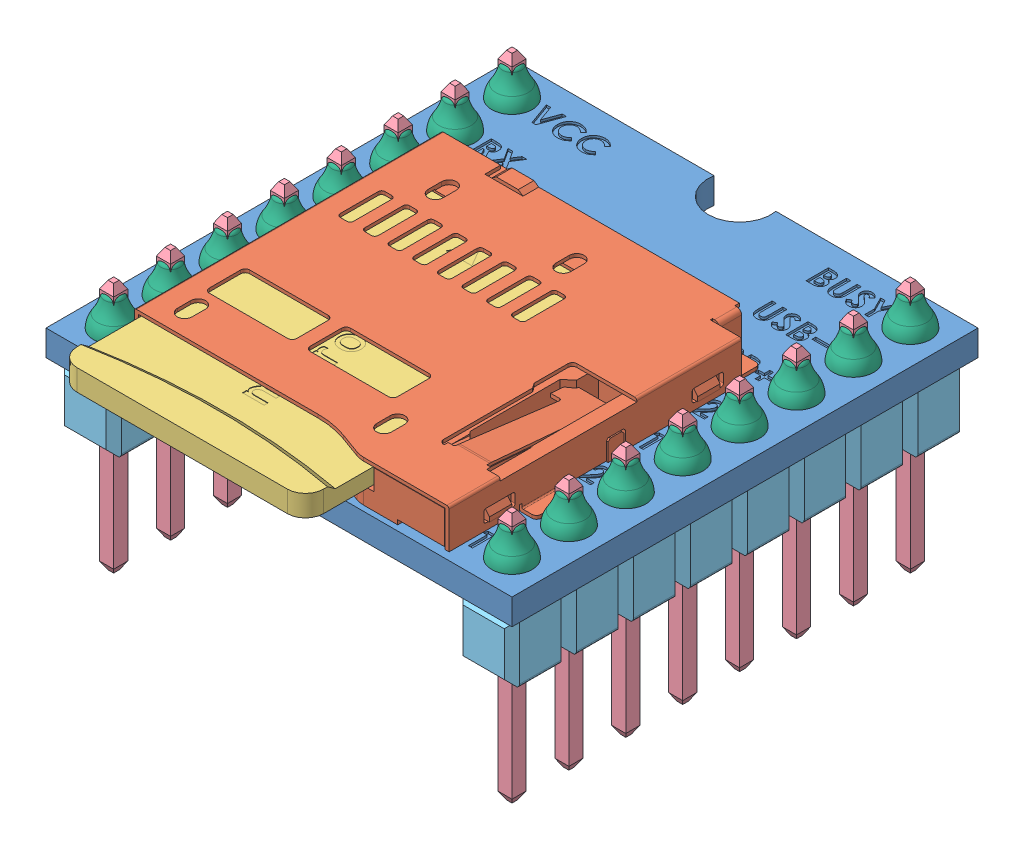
SolidWorks assembly DFPlayer Mini Assem.SLDASM, configuration Default (file format 9000). Lengths in mm.
Overall size (20.8 11.2 23.46).
68 component instances, 6 part files, 8 mates.
Components (placement in the parent):
- DFPlayer Mini PCB-1: DFPlayer Mini PCB.SLDPRT [Default] at origin size (20.8 1.15 20.8)
- SD card Assem-1: SD card Assem.SLDASM [Default] at (-198.0203 122.5536 -43.8714) x (0 1 0) z (1 0 0) size (2.44 17.9 16)
  - CD card slot-2: CD card slot.sldprt [Default] at (-120.5536 47.0914 197.6703) x (0 0 1) z (1 0 0) size (16 15 2.44)
  - Micro sd card-2: Micro sd card.sldprt [Default] at (-120.5536 45.5089 151.9853) x (0 0 1) z (1 0 0) size (11 15 0.95)
- DFPlayer Mini Pin-1: DFPlayer Mini Pin.SLDASM [Default] at (8.89 0 8.89) x (0 0 -1) z (0 -1 0) size (2.54 2.54 11.2)
  - 11_20mm pin-2: 11_20mm pin.SLDPRT [Default] at (0 0 2.6) size (0.63 0.63 11.2)
  - Pin Header 1x12 TH Pitch 2.54mm_04-1: Pin Header 1x12 TH Pitch 2.54mm_04.SLDPRT [Default] at (-27.94 0 -0.0014) size (2.54 2.54 2.8)
  - solder-1: solder.SLDPRT [Default] at (0 0 -1.15) x (1 0 0) z (0 1 0) size (1.8 1.45 1.8)
- DFPlayer Mini Pin-17: DFPlayer Mini Pin.SLDASM [Default] at (-8.89 0 8.89) x (0 0 1) z (0 -1 0) size (2.54 2.54 11.2)
  - 11_20mm pin-2: 11_20mm pin.SLDPRT [Default] at (0 0 2.6) size (0.63 0.63 11.2)
  - Pin Header 1x12 TH Pitch 2.54mm_04-1: Pin Header 1x12 TH Pitch 2.54mm_04.SLDPRT [Default] at (-27.94 0 -0.0014) size (2.54 2.54 2.8)
  - solder-1: solder.SLDPRT [Default] at (0 0 -1.15) x (1 0 0) z (0 1 0) size (1.8 1.45 1.8)
- DFPlayer Mini Pin-18: DFPlayer Mini Pin.SLDASM [Default] at (-8.89 0 6.35) x (0 0 1) z (0 -1 0) size (2.54 2.54 11.2)
  - 11_20mm pin-2: 11_20mm pin.SLDPRT [Default] at (0 0 2.6) size (0.63 0.63 11.2)
  - Pin Header 1x12 TH Pitch 2.54mm_04-1: Pin Header 1x12 TH Pitch 2.54mm_04.SLDPRT [Default] at (-27.94 0 -0.0014) size (2.54 2.54 2.8)
  - solder-1: solder.SLDPRT [Default] at (0 0 -1.15) x (1 0 0) z (0 1 0) size (1.8 1.45 1.8)
- DFPlayer Mini Pin-19: DFPlayer Mini Pin.SLDASM [Default] at (-8.89 0 3.81) x (0 0 1) z (0 -1 0) size (2.54 2.54 11.2)
  - 11_20mm pin-2: 11_20mm pin.SLDPRT [Default] at (0 0 2.6) size (0.63 0.63 11.2)
  - Pin Header 1x12 TH Pitch 2.54mm_04-1: Pin Header 1x12 TH Pitch 2.54mm_04.SLDPRT [Default] at (-27.94 0 -0.0014) size (2.54 2.54 2.8)
  - solder-1: solder.SLDPRT [Default] at (0 0 -1.15) x (1 0 0) z (0 1 0) size (1.8 1.45 1.8)
- DFPlayer Mini Pin-20: DFPlayer Mini Pin.SLDASM [Default] at (-8.89 0 1.27) x (0 0 1) z (0 -1 0) size (2.54 2.54 11.2)
  - 11_20mm pin-2: 11_20mm pin.SLDPRT [Default] at (0 0 2.6) size (0.63 0.63 11.2)
  - Pin Header 1x12 TH Pitch 2.54mm_04-1: Pin Header 1x12 TH Pitch 2.54mm_04.SLDPRT [Default] at (-27.94 0 -0.0014) size (2.54 2.54 2.8)
  - solder-1: solder.SLDPRT [Default] at (0 0 -1.15) x (1 0 0) z (0 1 0) size (1.8 1.45 1.8)
- DFPlayer Mini Pin-21: DFPlayer Mini Pin.SLDASM [Default] at (-8.89 0 -1.27) x (0 0 1) z (0 -1 0) size (2.54 2.54 11.2)
  - 11_20mm pin-2: 11_20mm pin.SLDPRT [Default] at (0 0 2.6) size (0.63 0.63 11.2)
  - Pin Header 1x12 TH Pitch 2.54mm_04-1: Pin Header 1x12 TH Pitch 2.54mm_04.SLDPRT [Default] at (-27.94 0 -0.0014) size (2.54 2.54 2.8)
  - solder-1: solder.SLDPRT [Default] at (0 0 -1.15) x (1 0 0) z (0 1 0) size (1.8 1.45 1.8)
- DFPlayer Mini Pin-22: DFPlayer Mini Pin.SLDASM [Default] at (-8.89 0 -3.81) x (0 0 1) z (0 -1 0) size (2.54 2.54 11.2)
  - 11_20mm pin-2: 11_20mm pin.SLDPRT [Default] at (0 0 2.6) size (0.63 0.63 11.2)
  - Pin Header 1x12 TH Pitch 2.54mm_04-1: Pin Header 1x12 TH Pitch 2.54mm_04.SLDPRT [Default] at (-27.94 0 -0.0014) size (2.54 2.54 2.8)
  - solder-1: solder.SLDPRT [Default] at (0 0 -1.15) x (1 0 0) z (0 1 0) size (1.8 1.45 1.8)
- DFPlayer Mini Pin-23: DFPlayer Mini Pin.SLDASM [Default] at (-8.89 0 -6.35) x (0 0 1) z (0 -1 0) size (2.54 2.54 11.2)
  - 11_20mm pin-2: 11_20mm pin.SLDPRT [Default] at (0 0 2.6) size (0.63 0.63 11.2)
  - Pin Header 1x12 TH Pitch 2.54mm_04-1: Pin Header 1x12 TH Pitch 2.54mm_04.SLDPRT [Default] at (-27.94 0 -0.0014) size (2.54 2.54 2.8)
  - solder-1: solder.SLDPRT [Default] at (0 0 -1.15) x (1 0 0) z (0 1 0) size (1.8 1.45 1.8)
- DFPlayer Mini Pin-24: DFPlayer Mini Pin.SLDASM [Default] at (-8.89 0 -8.89) x (0 0 1) z (0 -1 0) size (2.54 2.54 11.2)
  - 11_20mm pin-2: 11_20mm pin.SLDPRT [Default] at (0 0 2.6) size (0.63 0.63 11.2)
  - Pin Header 1x12 TH Pitch 2.54mm_04-1: Pin Header 1x12 TH Pitch 2.54mm_04.SLDPRT [Default] at (-27.94 0 -0.0014) size (2.54 2.54 2.8)
  - solder-1: solder.SLDPRT [Default] at (0 0 -1.15) x (1 0 0) z (0 1 0) size (1.8 1.45 1.8)
- DFPlayer Mini Pin-10: DFPlayer Mini Pin.SLDASM [Default] at (8.89 0 6.35) x (0 0 -1) z (0 -1 0) size (2.54 2.54 11.2)
  - 11_20mm pin-2: 11_20mm pin.SLDPRT [Default] at (0 0 2.6) size (0.63 0.63 11.2)
  - Pin Header 1x12 TH Pitch 2.54mm_04-1: Pin Header 1x12 TH Pitch 2.54mm_04.SLDPRT [Default] at (-27.94 0 -0.0014) size (2.54 2.54 2.8)
  - solder-1: solder.SLDPRT [Default] at (0 0 -1.15) x (1 0 0) z (0 1 0) size (1.8 1.45 1.8)
- DFPlayer Mini Pin-11: DFPlayer Mini Pin.SLDASM [Default] at (8.89 0 3.81) x (0 0 -1) z (0 -1 0) size (2.54 2.54 11.2)
  - 11_20mm pin-2: 11_20mm pin.SLDPRT [Default] at (0 0 2.6) size (0.63 0.63 11.2)
  - Pin Header 1x12 TH Pitch 2.54mm_04-1: Pin Header 1x12 TH Pitch 2.54mm_04.SLDPRT [Default] at (-27.94 0 -0.0014) size (2.54 2.54 2.8)
  - solder-1: solder.SLDPRT [Default] at (0 0 -1.15) x (1 0 0) z (0 1 0) size (1.8 1.45 1.8)
- DFPlayer Mini Pin-12: DFPlayer Mini Pin.SLDASM [Default] at (8.89 0 1.27) x (0 0 -1) z (0 -1 0) size (2.54 2.54 11.2)
  - 11_20mm pin-2: 11_20mm pin.SLDPRT [Default] at (0 0 2.6) size (0.63 0.63 11.2)
  - Pin Header 1x12 TH Pitch 2.54mm_04-1: Pin Header 1x12 TH Pitch 2.54mm_04.SLDPRT [Default] at (-27.94 0 -0.0014) size (2.54 2.54 2.8)
  - solder-1: solder.SLDPRT [Default] at (0 0 -1.15) x (1 0 0) z (0 1 0) size (1.8 1.45 1.8)
- DFPlayer Mini Pin-13: DFPlayer Mini Pin.SLDASM [Default] at (8.89 0 -1.27) x (0 0 -1) z (0 -1 0) size (2.54 2.54 11.2)
  - 11_20mm pin-2: 11_20mm pin.SLDPRT [Default] at (0 0 2.6) size (0.63 0.63 11.2)
  - Pin Header 1x12 TH Pitch 2.54mm_04-1: Pin Header 1x12 TH Pitch 2.54mm_04.SLDPRT [Default] at (-27.94 0 -0.0014) size (2.54 2.54 2.8)
  - solder-1: solder.SLDPRT [Default] at (0 0 -1.15) x (1 0 0) z (0 1 0) size (1.8 1.45 1.8)
- DFPlayer Mini Pin-14: DFPlayer Mini Pin.SLDASM [Default] at (8.89 0 -3.81) x (0 0 -1) z (0 -1 0) size (2.54 2.54 11.2)
  - 11_20mm pin-2: 11_20mm pin.SLDPRT [Default] at (0 0 2.6) size (0.63 0.63 11.2)
  - Pin Header 1x12 TH Pitch 2.54mm_04-1: Pin Header 1x12 TH Pitch 2.54mm_04.SLDPRT [Default] at (-27.94 0 -0.0014) size (2.54 2.54 2.8)
  - solder-1: solder.SLDPRT [Default] at (0 0 -1.15) x (1 0 0) z (0 1 0) size (1.8 1.45 1.8)
- DFPlayer Mini Pin-15: DFPlayer Mini Pin.SLDASM [Default] at (8.89 0 -6.35) x (0 0 -1) z (0 -1 0) size (2.54 2.54 11.2)
  - 11_20mm pin-2: 11_20mm pin.SLDPRT [Default] at (0 0 2.6) size (0.63 0.63 11.2)
  - Pin Header 1x12 TH Pitch 2.54mm_04-1: Pin Header 1x12 TH Pitch 2.54mm_04.SLDPRT [Default] at (-27.94 0 -0.0014) size (2.54 2.54 2.8)
  - solder-1: solder.SLDPRT [Default] at (0 0 -1.15) x (1 0 0) z (0 1 0) size (1.8 1.45 1.8)
- DFPlayer Mini Pin-16: DFPlayer Mini Pin.SLDASM [Default] at (8.89 0 -8.89) x (0 0 -1) z (0 -1 0) size (2.54 2.54 11.2)
  - 11_20mm pin-2: 11_20mm pin.SLDPRT [Default] at (0 0 2.6) size (0.63 0.63 11.2)
  - Pin Header 1x12 TH Pitch 2.54mm_04-1: Pin Header 1x12 TH Pitch 2.54mm_04.SLDPRT [Default] at (-27.94 0 -0.0014) size (2.54 2.54 2.8)
  - solder-1: solder.SLDPRT [Default] at (0 0 -1.15) x (1 0 0) z (0 1 0) size (1.8 1.45 1.8)
Mates (geometry in assembly coordinates):
- Coincident1: coincident anti-aligned: plane of DFPlayer Mini PCB-1 through (0 1.15 0) normal (0 1 0); plane of SD card Assem-1/CD card slot-2 through (2.14 1.15 8.47) normal (0 -1 0)
- Distance1: distance = 0.24 mm aligned: plane of SD card Assem-1/CD card slot-2 through (3.35 3 10.16) normal (0 0 1); plane of DFPlayer Mini PCB-1 through (-10.4 1.15 10.4) normal (0 0 1)
- Width1: width anti-aligned: plane of SD card Assem-1/CD card slot-2 through (-7.35 3 -4.09) normal (-1 0 0); plane of SD card Assem-1/CD card slot-2 through (7.35 1.25 -2.74) normal (1 0 0); plane of DFPlayer Mini PCB-1 through (10.4 1.15 -10.4) normal (1 0 0); plane of DFPlayer Mini PCB-1 through (-10.4 1.15 -10.4) normal (-1 0 0)
- Concentric11: concentric anti-aligned: cylinder of DFPlayer Mini PCB-1 through (8.89 1.15 8.89) axis (0 1 0) radius 0.5; cylinder of DFPlayer Mini Pin-1/solder-1 through (8.89 1.65 8.89) axis (0 -1 0) radius 0.5
- Coincident31: coincident anti-aligned: plane of DFPlayer Mini PCB-1 through (0 1.15 0) normal (0 1 0); plane of DFPlayer Mini Pin-1/solder-1 through (8.89 1.15 8.89) normal (0 -1 0)
- Concentric21: concentric anti-aligned: cylinder of DFPlayer Mini PCB-1 through (-8.89 1.15 8.89) axis (0 1 0) radius 0.5; cylinder of DFPlayer Mini Pin-17/solder-1 through (-8.89 1.65 8.89) axis (0 -1 0) radius 0.5
- Coincident41: coincident anti-aligned: plane of DFPlayer Mini PCB-1 through (0 1.15 0) normal (0 1 0); plane of DFPlayer Mini Pin-17/solder-1 through (-8.89 1.15 8.89) normal (0 -1 0)
- Coincident6: coincident aligned: plane of DFPlayer Mini Pin-1/Pin Header 1x12 TH Pitch 2.54mm_04-1 through (10.16 -2.7986 7.62) normal (0 0 -1); plane of DFPlayer Mini Pin-17/Pin Header 1x12 TH Pitch 2.54mm_04-1 through (-8.12 -2.7986 7.62) normal (0 0 -1)
